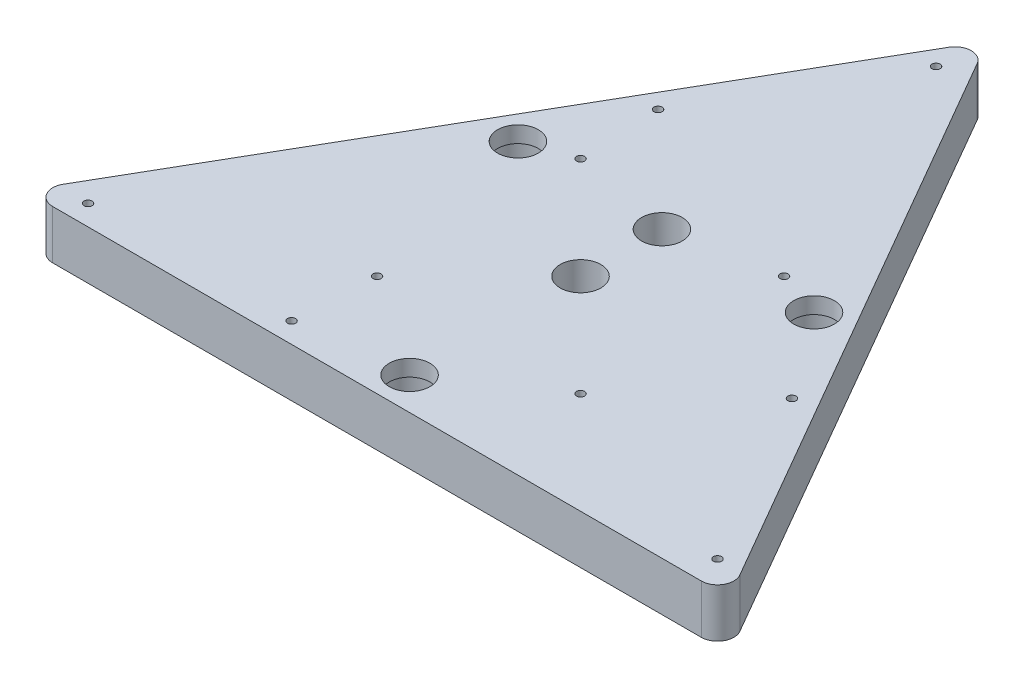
ISO-10303-21;
HEADER;
FILE_DESCRIPTION(('STEP AP214'),'2;1');
FILE_NAME('part.step','',(''),(''),'','','');
FILE_SCHEMA(('AUTOMOTIVE_DESIGN { 1 0 10303 214 1 1 1 1 }'));
ENDSEC;
DATA;
#1=APPLICATION_CONTEXT('core data for automotive mechanical design processes');
#2=APPLICATION_PROTOCOL_DEFINITION('international standard','automotive_design',2000,#1);
#3=PRODUCT_CONTEXT('',#1,'mechanical');
#4=PRODUCT('Part','Part','',(#3));
#5=PRODUCT_RELATED_PRODUCT_CATEGORY('part','',(#4));
#6=PRODUCT_DEFINITION_FORMATION('','',#4);
#7=PRODUCT_DEFINITION_CONTEXT('part definition',#1,'design');
#8=PRODUCT_DEFINITION('design','',#6,#7);
#9=PRODUCT_DEFINITION_SHAPE('','',#8);
#10=(LENGTH_UNIT() NAMED_UNIT(*) SI_UNIT(.MILLI.,.METRE.));
#11=(NAMED_UNIT(*) PLANE_ANGLE_UNIT() SI_UNIT($,.RADIAN.));
#12=(NAMED_UNIT(*) SI_UNIT($,.STERADIAN.) SOLID_ANGLE_UNIT());
#13=UNCERTAINTY_MEASURE_WITH_UNIT(LENGTH_MEASURE(1.E-05),#10,'distance_accuracy_value','');
#14=(GEOMETRIC_REPRESENTATION_CONTEXT(3) GLOBAL_UNCERTAINTY_ASSIGNED_CONTEXT((#13)) GLOBAL_UNIT_ASSIGNED_CONTEXT((#10,
#11,#12)) REPRESENTATION_CONTEXT('',''));
#15=CARTESIAN_POINT('',(0.,0.,0.));
#16=DIRECTION('',(0.,0.,1.));
#17=DIRECTION('',(1.,0.,0.));
#18=AXIS2_PLACEMENT_3D('',#15,#16,#17);
#19=CARTESIAN_POINT('',(43.3012701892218,-6.,25.0000000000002));
#20=DIRECTION('',(0.,1.,0.));
#21=DIRECTION('',(0.,0.,1.));
#22=AXIS2_PLACEMENT_3D('',#19,#20,#21);
#23=PLANE('',#22);
#24=CARTESIAN_POINT('',(18.1726583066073,-6.,-10.4919891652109));
#25=DIRECTION('',(0.,1.,0.));
#26=DIRECTION('',(0.,0.,1.));
#27=AXIS2_PLACEMENT_3D('',#24,#25,#26);
#28=CIRCLE('',#27,3.25);
#29=CARTESIAN_POINT('',(18.1726583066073,-6.,-7.24198916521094));
#30=VERTEX_POINT('',#29);
#31=EDGE_CURVE('E139',#30,#30,#28,.T.);
#32=ORIENTED_EDGE('',*,*,#31,.T.);
#33=EDGE_LOOP('',(#32));
#34=FACE_BOUND('',#33,.T.);
#35=DIRECTION('',(1.,0.,0.));
#36=VECTOR('',#35,1.);
#37=CARTESIAN_POINT('',(-43.3012701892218,-6.,25.0000000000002));
#38=LINE('',#37,#36);
#39=CARTESIAN_POINT('',(-39.8371685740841,-6.,25.0000000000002));
#40=VERTEX_POINT('',#39);
#41=CARTESIAN_POINT('',(39.8371685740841,-6.,25.0000000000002));
#42=VERTEX_POINT('',#41);
#43=EDGE_CURVE('E104',#40,#42,#38,.T.);
#44=ORIENTED_EDGE('',*,*,#43,.F.);
#45=CARTESIAN_POINT('',(-39.8371685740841,-6.,23.0000000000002));
#46=DIRECTION('',(0.,1.,0.));
#47=DIRECTION('',(0.,0.,1.));
#48=AXIS2_PLACEMENT_3D('',#45,#46,#47);
#49=CIRCLE('',#48,2.);
#50=CARTESIAN_POINT('',(-41.5692193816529,-6.,22.0000000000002));
#51=VERTEX_POINT('',#50);
#52=EDGE_CURVE('E123',#40,#51,#49,.F.);
#53=ORIENTED_EDGE('',*,*,#52,.T.);
#54=DIRECTION('',(-0.499999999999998,0.,0.86602540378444));
#55=VECTOR('',#54,1.);
#56=CARTESIAN_POINT('',(0.,-6.,-50.));
#57=LINE('',#56,#55);
#58=CARTESIAN_POINT('',(-1.73205080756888,-6.,-47.));
#59=VERTEX_POINT('',#58);
#60=EDGE_CURVE('E108',#59,#51,#57,.T.);
#61=ORIENTED_EDGE('',*,*,#60,.F.);
#62=CARTESIAN_POINT('',(0.,-6.,-46.));
#63=DIRECTION('',(0.,1.,0.));
#64=DIRECTION('',(0.,0.,1.));
#65=AXIS2_PLACEMENT_3D('',#62,#63,#64);
#66=CIRCLE('',#65,2.);
#67=CARTESIAN_POINT('',(1.73205080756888,-6.,-47.));
#68=VERTEX_POINT('',#67);
#69=EDGE_CURVE('E45',#59,#68,#66,.F.);
#70=ORIENTED_EDGE('',*,*,#69,.T.);
#71=DIRECTION('',(-0.499999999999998,0.,-0.86602540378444));
#72=VECTOR('',#71,1.);
#73=CARTESIAN_POINT('',(0.,-6.,-50.));
#74=LINE('',#73,#72);
#75=CARTESIAN_POINT('',(41.5692193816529,-6.,22.0000000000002));
#76=VERTEX_POINT('',#75);
#77=EDGE_CURVE('E232',#76,#68,#74,.T.);
#78=ORIENTED_EDGE('',*,*,#77,.F.);
#79=CARTESIAN_POINT('',(39.8371685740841,-6.,23.0000000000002));
#80=DIRECTION('',(0.,1.,0.));
#81=DIRECTION('',(0.,0.,1.));
#82=AXIS2_PLACEMENT_3D('',#79,#80,#81);
#83=CIRCLE('',#82,2.);
#84=EDGE_CURVE('E121',#76,#42,#83,.F.);
#85=ORIENTED_EDGE('',*,*,#84,.T.);
#86=EDGE_LOOP('',(#44,#53,#61,#70,#78,#85));
#87=FACE_BOUND('',#86,.T.);
#88=CARTESIAN_POINT('',(0.,-6.,0.));
#89=DIRECTION('',(0.,1.,0.));
#90=DIRECTION('',(0.,0.,1.));
#91=AXIS2_PLACEMENT_3D('',#88,#89,#90);
#92=CIRCLE('',#91,2.5);
#93=CARTESIAN_POINT('',(0.,-6.,2.5));
#94=VERTEX_POINT('',#93);
#95=EDGE_CURVE('E226',#94,#94,#92,.T.);
#96=ORIENTED_EDGE('',*,*,#95,.T.);
#97=EDGE_LOOP('',(#96));
#98=FACE_BOUND('',#97,.T.);
#99=CARTESIAN_POINT('',(38.48557158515,-6.,21.6589653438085));
#100=DIRECTION('',(0.,1.,0.));
#101=DIRECTION('',(0.,0.,1.));
#102=AXIS2_PLACEMENT_3D('',#99,#100,#101);
#103=CIRCLE('',#102,0.500000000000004);
#104=CARTESIAN_POINT('',(38.48557158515,-6.,22.1589653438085));
#105=VERTEX_POINT('',#104);
#106=EDGE_CURVE('E211',#105,#105,#103,.T.);
#107=ORIENTED_EDGE('',*,*,#106,.T.);
#108=EDGE_LOOP('',(#107));
#109=FACE_BOUND('',#108,.T.);
#110=CARTESIAN_POINT('',(25.9855715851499,-6.,0.00833024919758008));
#111=DIRECTION('',(0.,1.,0.));
#112=DIRECTION('',(0.,0.,1.));
#113=AXIS2_PLACEMENT_3D('',#110,#111,#112);
#114=CIRCLE('',#113,0.499999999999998);
#115=CARTESIAN_POINT('',(25.9855715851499,-6.,0.508330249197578));
#116=VERTEX_POINT('',#115);
#117=EDGE_CURVE('E205',#116,#116,#114,.T.);
#118=ORIENTED_EDGE('',*,*,#117,.T.);
#119=EDGE_LOOP('',(#118));
#120=FACE_BOUND('',#119,.T.);
#121=CARTESIAN_POINT('',(-0.48557158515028,-6.,-44.1589653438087));
#122=DIRECTION('',(0.,1.,0.));
#123=DIRECTION('',(0.,0.,1.));
#124=AXIS2_PLACEMENT_3D('',#121,#122,#123);
#125=CIRCLE('',#124,0.499999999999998);
#126=CARTESIAN_POINT('',(-0.48557158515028,-6.,-43.6589653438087));
#127=VERTEX_POINT('',#126);
#128=EDGE_CURVE('E199',#127,#127,#125,.T.);
#129=ORIENTED_EDGE('',*,*,#128,.T.);
#130=EDGE_LOOP('',(#129));
#131=FACE_BOUND('',#130,.T.);
#132=CARTESIAN_POINT('',(-12.9855715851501,-6.,-22.5083302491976));
#133=DIRECTION('',(0.,1.,0.));
#134=DIRECTION('',(0.,0.,1.));
#135=AXIS2_PLACEMENT_3D('',#132,#133,#134);
#136=CIRCLE('',#135,0.499999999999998);
#137=CARTESIAN_POINT('',(-12.9855715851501,-6.,-22.0083302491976));
#138=VERTEX_POINT('',#137);
#139=EDGE_CURVE('E193',#138,#138,#136,.T.);
#140=ORIENTED_EDGE('',*,*,#139,.T.);
#141=EDGE_LOOP('',(#140));
#142=FACE_BOUND('',#141,.T.);
#143=CARTESIAN_POINT('',(0.,-6.,-10.));
#144=DIRECTION('',(0.,1.,0.));
#145=DIRECTION('',(0.,0.,1.));
#146=AXIS2_PLACEMENT_3D('',#143,#144,#145);
#147=CIRCLE('',#146,2.5);
#148=CARTESIAN_POINT('',(0.,-6.,-7.5));
#149=VERTEX_POINT('',#148);
#150=EDGE_CURVE('E187',#149,#149,#147,.T.);
#151=ORIENTED_EDGE('',*,*,#150,.T.);
#152=EDGE_LOOP('',(#151));
#153=FACE_BOUND('',#152,.T.);
#154=CARTESIAN_POINT('',(-38.,-6.,22.5));
#155=DIRECTION('',(0.,1.,0.));
#156=DIRECTION('',(0.,0.,1.));
#157=AXIS2_PLACEMENT_3D('',#154,#155,#156);
#158=CIRCLE('',#157,0.499999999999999);
#159=CARTESIAN_POINT('',(-38.,-6.,23.));
#160=VERTEX_POINT('',#159);
#161=EDGE_CURVE('E181',#160,#160,#158,.T.);
#162=ORIENTED_EDGE('',*,*,#161,.T.);
#163=EDGE_LOOP('',(#162));
#164=FACE_BOUND('',#163,.T.);
#165=CARTESIAN_POINT('',(12.5,-6.,-12.5));
#166=DIRECTION('',(0.,1.,0.));
#167=DIRECTION('',(0.,0.,1.));
#168=AXIS2_PLACEMENT_3D('',#165,#166,#167);
#169=CIRCLE('',#168,0.500000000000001);
#170=CARTESIAN_POINT('',(12.5,-6.,-12.));
#171=VERTEX_POINT('',#170);
#172=EDGE_CURVE('E175',#171,#171,#169,.T.);
#173=ORIENTED_EDGE('',*,*,#172,.T.);
#174=EDGE_LOOP('',(#173));
#175=FACE_BOUND('',#174,.T.);
#176=CARTESIAN_POINT('',(-13.,-6.,22.5));
#177=DIRECTION('',(0.,1.,0.));
#178=DIRECTION('',(0.,0.,1.));
#179=AXIS2_PLACEMENT_3D('',#176,#177,#178);
#180=CIRCLE('',#179,0.499999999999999);
#181=CARTESIAN_POINT('',(-13.,-6.,23.));
#182=VERTEX_POINT('',#181);
#183=EDGE_CURVE('E169',#182,#182,#180,.T.);
#184=ORIENTED_EDGE('',*,*,#183,.T.);
#185=EDGE_LOOP('',(#184));
#186=FACE_BOUND('',#185,.T.);
#187=CARTESIAN_POINT('',(-12.5,-6.,-12.5));
#188=DIRECTION('',(0.,1.,0.));
#189=DIRECTION('',(0.,0.,1.));
#190=AXIS2_PLACEMENT_3D('',#187,#188,#189);
#191=CIRCLE('',#190,0.500000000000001);
#192=CARTESIAN_POINT('',(-12.5,-6.,-12.));
#193=VERTEX_POINT('',#192);
#194=EDGE_CURVE('E163',#193,#193,#191,.T.);
#195=ORIENTED_EDGE('',*,*,#194,.T.);
#196=EDGE_LOOP('',(#195));
#197=FACE_BOUND('',#196,.T.);
#198=CARTESIAN_POINT('',(-12.4999999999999,-6.,12.5000000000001));
#199=DIRECTION('',(0.,1.,0.));
#200=DIRECTION('',(0.,0.,1.));
#201=AXIS2_PLACEMENT_3D('',#198,#199,#200);
#202=CIRCLE('',#201,0.5);
#203=CARTESIAN_POINT('',(-12.4999999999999,-6.,13.0000000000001));
#204=VERTEX_POINT('',#203);
#205=EDGE_CURVE('E157',#204,#204,#202,.T.);
#206=ORIENTED_EDGE('',*,*,#205,.T.);
#207=EDGE_LOOP('',(#206));
#208=FACE_BOUND('',#207,.T.);
#209=CARTESIAN_POINT('',(12.5000000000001,-6.,12.4999999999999));
#210=DIRECTION('',(0.,1.,0.));
#211=DIRECTION('',(0.,0.,1.));
#212=AXIS2_PLACEMENT_3D('',#209,#210,#211);
#213=CIRCLE('',#212,0.500000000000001);
#214=CARTESIAN_POINT('',(12.5000000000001,-6.,12.9999999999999));
#215=VERTEX_POINT('',#214);
#216=EDGE_CURVE('E151',#215,#215,#213,.T.);
#217=ORIENTED_EDGE('',*,*,#216,.T.);
#218=EDGE_LOOP('',(#217));
#219=FACE_BOUND('',#218,.T.);
#220=CARTESIAN_POINT('',(0.,-6.,20.9839783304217));
#221=DIRECTION('',(0.,1.,0.));
#222=DIRECTION('',(0.,0.,1.));
#223=AXIS2_PLACEMENT_3D('',#220,#221,#222);
#224=CIRCLE('',#223,3.25);
#225=CARTESIAN_POINT('',(0.,-6.,24.2339783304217));
#226=VERTEX_POINT('',#225);
#227=EDGE_CURVE('E132',#226,#226,#224,.T.);
#228=ORIENTED_EDGE('',*,*,#227,.T.);
#229=EDGE_LOOP('',(#228));
#230=FACE_BOUND('',#229,.T.);
#231=CARTESIAN_POINT('',(-18.1726583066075,-6.,-10.4919891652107));
#232=DIRECTION('',(0.,1.,0.));
#233=DIRECTION('',(0.,0.,1.));
#234=AXIS2_PLACEMENT_3D('',#231,#232,#233);
#235=CIRCLE('',#234,3.25);
#236=CARTESIAN_POINT('',(-18.1726583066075,-6.,-7.24198916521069));
#237=VERTEX_POINT('',#236);
#238=EDGE_CURVE('E277',#237,#237,#235,.T.);
#239=ORIENTED_EDGE('',*,*,#238,.T.);
#240=EDGE_LOOP('',(#239));
#241=FACE_BOUND('',#240,.T.);
#242=ADVANCED_FACE('F28',(#34,#87,#98,#109,#120,#131,#142,#153,#164,#175,#186,#197,#208,#219,
#230,#241),#23,.F.);
#243=CARTESIAN_POINT('',(0.,-6.,-50.));
#244=DIRECTION('',(0.86602540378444,0.,-0.499999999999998));
#245=DIRECTION('',(-0.499999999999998,0.,-0.86602540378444));
#246=AXIS2_PLACEMENT_3D('',#243,#244,#245);
#247=PLANE('',#246);
#248=DIRECTION('',(-0.499999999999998,0.,-0.86602540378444));
#249=VECTOR('',#248,1.);
#250=CARTESIAN_POINT('',(0.,0.,-50.));
#251=LINE('',#250,#249);
#252=CARTESIAN_POINT('',(41.5692193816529,0.,22.0000000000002));
#253=VERTEX_POINT('',#252);
#254=CARTESIAN_POINT('',(1.73205080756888,0.,-47.));
#255=VERTEX_POINT('',#254);
#256=EDGE_CURVE('E87',#253,#255,#251,.T.);
#257=ORIENTED_EDGE('',*,*,#256,.F.);
#258=DIRECTION('',(0.,1.,0.));
#259=VECTOR('',#258,1.);
#260=CARTESIAN_POINT('',(41.5692193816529,-6.,22.0000000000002));
#261=LINE('',#260,#259);
#262=EDGE_CURVE('E11',#253,#76,#261,.F.);
#263=ORIENTED_EDGE('',*,*,#262,.T.);
#264=ORIENTED_EDGE('',*,*,#77,.T.);
#265=DIRECTION('',(0.,1.,0.));
#266=VECTOR('',#265,1.);
#267=CARTESIAN_POINT('',(1.73205080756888,-6.,-47.));
#268=LINE('',#267,#266);
#269=EDGE_CURVE('E37',#68,#255,#268,.T.);
#270=ORIENTED_EDGE('',*,*,#269,.T.);
#271=EDGE_LOOP('',(#257,#263,#264,#270));
#272=FACE_BOUND('',#271,.T.);
#273=ADVANCED_FACE('F30',(#272),#247,.T.);
#274=CARTESIAN_POINT('',(-43.3012701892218,-6.,25.0000000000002));
#275=DIRECTION('',(0.,0.,1.));
#276=DIRECTION('',(1.,0.,0.));
#277=AXIS2_PLACEMENT_3D('',#274,#275,#276);
#278=PLANE('',#277);
#279=DIRECTION('',(1.,0.,0.));
#280=VECTOR('',#279,1.);
#281=CARTESIAN_POINT('',(-43.3012701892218,0.,25.0000000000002));
#282=LINE('',#281,#280);
#283=CARTESIAN_POINT('',(-39.8371685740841,0.,25.0000000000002));
#284=VERTEX_POINT('',#283);
#285=CARTESIAN_POINT('',(39.8371685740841,0.,25.0000000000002));
#286=VERTEX_POINT('',#285);
#287=EDGE_CURVE('E101',#284,#286,#282,.T.);
#288=ORIENTED_EDGE('',*,*,#287,.F.);
#289=DIRECTION('',(0.,1.,0.));
#290=VECTOR('',#289,1.);
#291=CARTESIAN_POINT('',(-39.8371685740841,-6.,25.0000000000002));
#292=LINE('',#291,#290);
#293=EDGE_CURVE('E118',#284,#40,#292,.F.);
#294=ORIENTED_EDGE('',*,*,#293,.T.);
#295=ORIENTED_EDGE('',*,*,#43,.T.);
#296=DIRECTION('',(0.,1.,0.));
#297=VECTOR('',#296,1.);
#298=CARTESIAN_POINT('',(39.8371685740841,-6.,25.0000000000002));
#299=LINE('',#298,#297);
#300=EDGE_CURVE('E115',#42,#286,#299,.T.);
#301=ORIENTED_EDGE('',*,*,#300,.T.);
#302=EDGE_LOOP('',(#288,#294,#295,#301));
#303=FACE_BOUND('',#302,.T.);
#304=ADVANCED_FACE('F239',(#303),#278,.T.);
#305=CARTESIAN_POINT('',(0.,-6.,-50.));
#306=DIRECTION('',(-0.86602540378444,0.,-0.499999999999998));
#307=DIRECTION('',(-0.499999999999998,0.,0.86602540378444));
#308=AXIS2_PLACEMENT_3D('',#305,#306,#307);
#309=PLANE('',#308);
#310=ORIENTED_EDGE('',*,*,#60,.T.);
#311=DIRECTION('',(0.,1.,0.));
#312=VECTOR('',#311,1.);
#313=CARTESIAN_POINT('',(-41.5692193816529,-6.,22.0000000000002));
#314=LINE('',#313,#312);
#315=CARTESIAN_POINT('',(-41.5692193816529,0.,22.0000000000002));
#316=VERTEX_POINT('',#315);
#317=EDGE_CURVE('E93',#51,#316,#314,.T.);
#318=ORIENTED_EDGE('',*,*,#317,.T.);
#319=DIRECTION('',(-0.499999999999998,0.,0.86602540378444));
#320=VECTOR('',#319,1.);
#321=CARTESIAN_POINT('',(0.,0.,-50.));
#322=LINE('',#321,#320);
#323=CARTESIAN_POINT('',(-1.73205080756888,0.,-47.));
#324=VERTEX_POINT('',#323);
#325=EDGE_CURVE('E86',#324,#316,#322,.T.);
#326=ORIENTED_EDGE('',*,*,#325,.F.);
#327=DIRECTION('',(0.,1.,0.));
#328=VECTOR('',#327,1.);
#329=CARTESIAN_POINT('',(-1.73205080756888,-6.,-47.));
#330=LINE('',#329,#328);
#331=EDGE_CURVE('E99',#324,#59,#330,.F.);
#332=ORIENTED_EDGE('',*,*,#331,.T.);
#333=EDGE_LOOP('',(#310,#318,#326,#332));
#334=FACE_BOUND('',#333,.T.);
#335=ADVANCED_FACE('F98',(#334),#309,.T.);
#336=CARTESIAN_POINT('',(43.3012701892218,0.,25.0000000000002));
#337=DIRECTION('',(0.,1.,0.));
#338=DIRECTION('',(0.,0.,1.));
#339=AXIS2_PLACEMENT_3D('',#336,#337,#338);
#340=PLANE('',#339);
#341=CARTESIAN_POINT('',(12.5000000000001,0.,12.4999999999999));
#342=DIRECTION('',(0.,1.,0.));
#343=DIRECTION('',(0.,0.,1.));
#344=AXIS2_PLACEMENT_3D('',#341,#342,#343);
#345=CIRCLE('',#344,0.500000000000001);
#346=CARTESIAN_POINT('',(12.5000000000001,0.,12.9999999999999));
#347=VERTEX_POINT('',#346);
#348=EDGE_CURVE('E128',#347,#347,#345,.T.);
#349=ORIENTED_EDGE('',*,*,#348,.F.);
#350=EDGE_LOOP('',(#349));
#351=FACE_BOUND('',#350,.T.);
#352=CARTESIAN_POINT('',(-12.4999999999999,0.,12.5000000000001));
#353=DIRECTION('',(0.,1.,0.));
#354=DIRECTION('',(0.,0.,1.));
#355=AXIS2_PLACEMENT_3D('',#352,#353,#354);
#356=CIRCLE('',#355,0.5);
#357=CARTESIAN_POINT('',(-12.4999999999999,0.,13.0000000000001));
#358=VERTEX_POINT('',#357);
#359=EDGE_CURVE('E154',#358,#358,#356,.T.);
#360=ORIENTED_EDGE('',*,*,#359,.F.);
#361=EDGE_LOOP('',(#360));
#362=FACE_BOUND('',#361,.T.);
#363=CARTESIAN_POINT('',(-12.5,0.,-12.5));
#364=DIRECTION('',(0.,1.,0.));
#365=DIRECTION('',(0.,0.,1.));
#366=AXIS2_PLACEMENT_3D('',#363,#364,#365);
#367=CIRCLE('',#366,0.500000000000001);
#368=CARTESIAN_POINT('',(-12.5,0.,-12.));
#369=VERTEX_POINT('',#368);
#370=EDGE_CURVE('E160',#369,#369,#367,.T.);
#371=ORIENTED_EDGE('',*,*,#370,.F.);
#372=EDGE_LOOP('',(#371));
#373=FACE_BOUND('',#372,.T.);
#374=CARTESIAN_POINT('',(-13.,0.,22.5));
#375=DIRECTION('',(0.,1.,0.));
#376=DIRECTION('',(0.,0.,1.));
#377=AXIS2_PLACEMENT_3D('',#374,#375,#376);
#378=CIRCLE('',#377,0.499999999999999);
#379=CARTESIAN_POINT('',(-13.,0.,23.));
#380=VERTEX_POINT('',#379);
#381=EDGE_CURVE('E166',#380,#380,#378,.T.);
#382=ORIENTED_EDGE('',*,*,#381,.F.);
#383=EDGE_LOOP('',(#382));
#384=FACE_BOUND('',#383,.T.);
#385=CARTESIAN_POINT('',(12.5,0.,-12.5));
#386=DIRECTION('',(0.,1.,0.));
#387=DIRECTION('',(0.,0.,1.));
#388=AXIS2_PLACEMENT_3D('',#385,#386,#387);
#389=CIRCLE('',#388,0.500000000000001);
#390=CARTESIAN_POINT('',(12.5,0.,-12.));
#391=VERTEX_POINT('',#390);
#392=EDGE_CURVE('E172',#391,#391,#389,.T.);
#393=ORIENTED_EDGE('',*,*,#392,.F.);
#394=EDGE_LOOP('',(#393));
#395=FACE_BOUND('',#394,.T.);
#396=CARTESIAN_POINT('',(-38.,0.,22.5));
#397=DIRECTION('',(0.,1.,0.));
#398=DIRECTION('',(0.,0.,1.));
#399=AXIS2_PLACEMENT_3D('',#396,#397,#398);
#400=CIRCLE('',#399,0.499999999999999);
#401=CARTESIAN_POINT('',(-38.,0.,23.));
#402=VERTEX_POINT('',#401);
#403=EDGE_CURVE('E178',#402,#402,#400,.T.);
#404=ORIENTED_EDGE('',*,*,#403,.F.);
#405=EDGE_LOOP('',(#404));
#406=FACE_BOUND('',#405,.T.);
#407=CARTESIAN_POINT('',(0.,0.,-10.));
#408=DIRECTION('',(0.,1.,0.));
#409=DIRECTION('',(0.,0.,1.));
#410=AXIS2_PLACEMENT_3D('',#407,#408,#409);
#411=CIRCLE('',#410,2.5);
#412=CARTESIAN_POINT('',(0.,0.,-7.5));
#413=VERTEX_POINT('',#412);
#414=EDGE_CURVE('E184',#413,#413,#411,.T.);
#415=ORIENTED_EDGE('',*,*,#414,.F.);
#416=EDGE_LOOP('',(#415));
#417=FACE_BOUND('',#416,.T.);
#418=CARTESIAN_POINT('',(-12.9855715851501,0.,-22.5083302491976));
#419=DIRECTION('',(0.,1.,0.));
#420=DIRECTION('',(0.,0.,1.));
#421=AXIS2_PLACEMENT_3D('',#418,#419,#420);
#422=CIRCLE('',#421,0.499999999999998);
#423=CARTESIAN_POINT('',(-12.9855715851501,0.,-22.0083302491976));
#424=VERTEX_POINT('',#423);
#425=EDGE_CURVE('E190',#424,#424,#422,.T.);
#426=ORIENTED_EDGE('',*,*,#425,.F.);
#427=EDGE_LOOP('',(#426));
#428=FACE_BOUND('',#427,.T.);
#429=CARTESIAN_POINT('',(-0.48557158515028,0.,-44.1589653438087));
#430=DIRECTION('',(0.,1.,0.));
#431=DIRECTION('',(0.,0.,1.));
#432=AXIS2_PLACEMENT_3D('',#429,#430,#431);
#433=CIRCLE('',#432,0.499999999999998);
#434=CARTESIAN_POINT('',(-0.48557158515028,0.,-43.6589653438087));
#435=VERTEX_POINT('',#434);
#436=EDGE_CURVE('E196',#435,#435,#433,.T.);
#437=ORIENTED_EDGE('',*,*,#436,.F.);
#438=EDGE_LOOP('',(#437));
#439=FACE_BOUND('',#438,.T.);
#440=CARTESIAN_POINT('',(25.9855715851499,0.,0.00833024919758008));
#441=DIRECTION('',(0.,1.,0.));
#442=DIRECTION('',(0.,0.,1.));
#443=AXIS2_PLACEMENT_3D('',#440,#441,#442);
#444=CIRCLE('',#443,0.499999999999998);
#445=CARTESIAN_POINT('',(25.9855715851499,0.,0.508330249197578));
#446=VERTEX_POINT('',#445);
#447=EDGE_CURVE('E202',#446,#446,#444,.T.);
#448=ORIENTED_EDGE('',*,*,#447,.F.);
#449=EDGE_LOOP('',(#448));
#450=FACE_BOUND('',#449,.T.);
#451=CARTESIAN_POINT('',(38.48557158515,0.,21.6589653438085));
#452=DIRECTION('',(0.,1.,0.));
#453=DIRECTION('',(0.,0.,1.));
#454=AXIS2_PLACEMENT_3D('',#451,#452,#453);
#455=CIRCLE('',#454,0.500000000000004);
#456=CARTESIAN_POINT('',(38.48557158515,0.,22.1589653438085));
#457=VERTEX_POINT('',#456);
#458=EDGE_CURVE('E208',#457,#457,#455,.T.);
#459=ORIENTED_EDGE('',*,*,#458,.F.);
#460=EDGE_LOOP('',(#459));
#461=FACE_BOUND('',#460,.T.);
#462=CARTESIAN_POINT('',(18.186533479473,0.,-10.5000000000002));
#463=DIRECTION('',(0.,1.,0.));
#464=DIRECTION('',(0.,0.,1.));
#465=AXIS2_PLACEMENT_3D('',#462,#463,#464);
#466=CIRCLE('',#465,2.5);
#467=CARTESIAN_POINT('',(18.186533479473,0.,-8.00000000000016));
#468=VERTEX_POINT('',#467);
#469=EDGE_CURVE('E214',#468,#468,#466,.T.);
#470=ORIENTED_EDGE('',*,*,#469,.F.);
#471=EDGE_LOOP('',(#470));
#472=FACE_BOUND('',#471,.T.);
#473=CARTESIAN_POINT('',(1.50310231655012E-13,0.,20.9999999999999));
#474=DIRECTION('',(0.,1.,0.));
#475=DIRECTION('',(0.,0.,1.));
#476=AXIS2_PLACEMENT_3D('',#473,#474,#475);
#477=CIRCLE('',#476,2.5);
#478=CARTESIAN_POINT('',(1.50310231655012E-13,0.,23.4999999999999));
#479=VERTEX_POINT('',#478);
#480=EDGE_CURVE('E217',#479,#479,#477,.T.);
#481=ORIENTED_EDGE('',*,*,#480,.F.);
#482=EDGE_LOOP('',(#481));
#483=FACE_BOUND('',#482,.T.);
#484=CARTESIAN_POINT('',(-18.1865334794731,0.,-10.4999999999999));
#485=DIRECTION('',(0.,1.,0.));
#486=DIRECTION('',(0.,0.,1.));
#487=AXIS2_PLACEMENT_3D('',#484,#485,#486);
#488=CIRCLE('',#487,2.5);
#489=CARTESIAN_POINT('',(-18.1865334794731,0.,-7.9999999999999));
#490=VERTEX_POINT('',#489);
#491=EDGE_CURVE('E220',#490,#490,#488,.T.);
#492=ORIENTED_EDGE('',*,*,#491,.F.);
#493=EDGE_LOOP('',(#492));
#494=FACE_BOUND('',#493,.T.);
#495=CARTESIAN_POINT('',(0.,0.,0.));
#496=DIRECTION('',(0.,1.,0.));
#497=DIRECTION('',(0.,0.,1.));
#498=AXIS2_PLACEMENT_3D('',#495,#496,#497);
#499=CIRCLE('',#498,2.5);
#500=CARTESIAN_POINT('',(0.,0.,2.5));
#501=VERTEX_POINT('',#500);
#502=EDGE_CURVE('E223',#501,#501,#499,.T.);
#503=ORIENTED_EDGE('',*,*,#502,.F.);
#504=EDGE_LOOP('',(#503));
#505=FACE_BOUND('',#504,.T.);
#506=ORIENTED_EDGE('',*,*,#325,.T.);
#507=CARTESIAN_POINT('',(-39.8371685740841,0.,23.0000000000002));
#508=DIRECTION('',(0.,1.,0.));
#509=DIRECTION('',(0.,0.,1.));
#510=AXIS2_PLACEMENT_3D('',#507,#508,#509);
#511=CIRCLE('',#510,2.);
#512=EDGE_CURVE('E113',#316,#284,#511,.T.);
#513=ORIENTED_EDGE('',*,*,#512,.T.);
#514=ORIENTED_EDGE('',*,*,#287,.T.);
#515=CARTESIAN_POINT('',(39.8371685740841,0.,23.0000000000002));
#516=DIRECTION('',(0.,1.,0.));
#517=DIRECTION('',(0.,0.,1.));
#518=AXIS2_PLACEMENT_3D('',#515,#516,#517);
#519=CIRCLE('',#518,2.);
#520=EDGE_CURVE('E92',#286,#253,#519,.T.);
#521=ORIENTED_EDGE('',*,*,#520,.T.);
#522=ORIENTED_EDGE('',*,*,#256,.T.);
#523=CARTESIAN_POINT('',(0.,0.,-46.));
#524=DIRECTION('',(0.,1.,0.));
#525=DIRECTION('',(0.,0.,1.));
#526=AXIS2_PLACEMENT_3D('',#523,#524,#525);
#527=CIRCLE('',#526,2.);
#528=EDGE_CURVE('E83',#255,#324,#527,.T.);
#529=ORIENTED_EDGE('',*,*,#528,.T.);
#530=EDGE_LOOP('',(#506,#513,#514,#521,#522,#529));
#531=FACE_BOUND('',#530,.T.);
#532=ADVANCED_FACE('F85',(#351,#362,#373,#384,#395,#406,#417,#428,#439,#450,#461,#472,#483,#494,
#505,#531),#340,.T.);
#533=CARTESIAN_POINT('',(0.,-6.,0.));
#534=DIRECTION('',(0.,1.,0.));
#535=DIRECTION('',(0.,0.,1.));
#536=AXIS2_PLACEMENT_3D('',#533,#534,#535);
#537=CYLINDRICAL_SURFACE('',#536,2.5);
#538=ORIENTED_EDGE('',*,*,#95,.F.);
#539=EDGE_LOOP('',(#538));
#540=FACE_BOUND('',#539,.T.);
#541=ORIENTED_EDGE('',*,*,#502,.T.);
#542=EDGE_LOOP('',(#541));
#543=FACE_BOUND('',#542,.T.);
#544=ADVANCED_FACE('F374',(#540,#543),#537,.F.);
#545=CARTESIAN_POINT('',(-18.1865334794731,-6.,-10.4999999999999));
#546=DIRECTION('',(0.,1.,0.));
#547=DIRECTION('',(0.,0.,1.));
#548=AXIS2_PLACEMENT_3D('',#545,#546,#547);
#549=CYLINDRICAL_SURFACE('',#548,2.5);
#550=CARTESIAN_POINT('',(-18.1865334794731,-2.,-10.4999999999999));
#551=DIRECTION('',(0.,1.,0.));
#552=DIRECTION('',(0.,0.,1.));
#553=AXIS2_PLACEMENT_3D('',#550,#551,#552);
#554=CIRCLE('',#553,2.5);
#555=CARTESIAN_POINT('',(-18.1865334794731,-2.,-7.9999999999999));
#556=VERTEX_POINT('',#555);
#557=EDGE_CURVE('E32',#556,#556,#554,.F.);
#558=ORIENTED_EDGE('',*,*,#557,.T.);
#559=EDGE_LOOP('',(#558));
#560=FACE_BOUND('',#559,.T.);
#561=ORIENTED_EDGE('',*,*,#491,.T.);
#562=EDGE_LOOP('',(#561));
#563=FACE_BOUND('',#562,.T.);
#564=ADVANCED_FACE('F287',(#560,#563),#549,.F.);
#565=CARTESIAN_POINT('',(1.50310231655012E-13,-6.,20.9999999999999));
#566=DIRECTION('',(0.,1.,0.));
#567=DIRECTION('',(0.,0.,1.));
#568=AXIS2_PLACEMENT_3D('',#565,#566,#567);
#569=CYLINDRICAL_SURFACE('',#568,2.5);
#570=CARTESIAN_POINT('',(1.50310231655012E-13,-2.,20.9999999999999));
#571=DIRECTION('',(0.,1.,0.));
#572=DIRECTION('',(0.,0.,1.));
#573=AXIS2_PLACEMENT_3D('',#570,#571,#572);
#574=CIRCLE('',#573,2.5);
#575=CARTESIAN_POINT('',(1.50310231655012E-13,-2.,23.4999999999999));
#576=VERTEX_POINT('',#575);
#577=EDGE_CURVE('E126',#576,#576,#574,.F.);
#578=ORIENTED_EDGE('',*,*,#577,.T.);
#579=EDGE_LOOP('',(#578));
#580=FACE_BOUND('',#579,.T.);
#581=ORIENTED_EDGE('',*,*,#480,.T.);
#582=EDGE_LOOP('',(#581));
#583=FACE_BOUND('',#582,.T.);
#584=ADVANCED_FACE('F368',(#580,#583),#569,.F.);
#585=CARTESIAN_POINT('',(18.186533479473,-6.,-10.5000000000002));
#586=DIRECTION('',(0.,1.,0.));
#587=DIRECTION('',(0.,0.,1.));
#588=AXIS2_PLACEMENT_3D('',#585,#586,#587);
#589=CYLINDRICAL_SURFACE('',#588,2.5);
#590=CARTESIAN_POINT('',(18.186533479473,-2.,-10.5000000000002));
#591=DIRECTION('',(0.,1.,0.));
#592=DIRECTION('',(0.,0.,1.));
#593=AXIS2_PLACEMENT_3D('',#590,#591,#592);
#594=CIRCLE('',#593,2.5);
#595=CARTESIAN_POINT('',(18.186533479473,-2.,-8.00000000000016));
#596=VERTEX_POINT('',#595);
#597=EDGE_CURVE('E130',#596,#596,#594,.F.);
#598=ORIENTED_EDGE('',*,*,#597,.T.);
#599=EDGE_LOOP('',(#598));
#600=FACE_BOUND('',#599,.T.);
#601=ORIENTED_EDGE('',*,*,#469,.T.);
#602=EDGE_LOOP('',(#601));
#603=FACE_BOUND('',#602,.T.);
#604=ADVANCED_FACE('F364',(#600,#603),#589,.F.);
#605=CARTESIAN_POINT('',(38.48557158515,-6.,21.6589653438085));
#606=DIRECTION('',(0.,1.,0.));
#607=DIRECTION('',(0.,0.,1.));
#608=AXIS2_PLACEMENT_3D('',#605,#606,#607);
#609=CYLINDRICAL_SURFACE('',#608,0.500000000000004);
#610=ORIENTED_EDGE('',*,*,#106,.F.);
#611=EDGE_LOOP('',(#610));
#612=FACE_BOUND('',#611,.T.);
#613=ORIENTED_EDGE('',*,*,#458,.T.);
#614=EDGE_LOOP('',(#613));
#615=FACE_BOUND('',#614,.T.);
#616=ADVANCED_FACE('F360',(#612,#615),#609,.F.);
#617=CARTESIAN_POINT('',(25.9855715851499,-6.,0.00833024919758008));
#618=DIRECTION('',(0.,1.,0.));
#619=DIRECTION('',(0.,0.,1.));
#620=AXIS2_PLACEMENT_3D('',#617,#618,#619);
#621=CYLINDRICAL_SURFACE('',#620,0.499999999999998);
#622=ORIENTED_EDGE('',*,*,#117,.F.);
#623=EDGE_LOOP('',(#622));
#624=FACE_BOUND('',#623,.T.);
#625=ORIENTED_EDGE('',*,*,#447,.T.);
#626=EDGE_LOOP('',(#625));
#627=FACE_BOUND('',#626,.T.);
#628=ADVANCED_FACE('F356',(#624,#627),#621,.F.);
#629=CARTESIAN_POINT('',(-0.48557158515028,-6.,-44.1589653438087));
#630=DIRECTION('',(0.,1.,0.));
#631=DIRECTION('',(0.,0.,1.));
#632=AXIS2_PLACEMENT_3D('',#629,#630,#631);
#633=CYLINDRICAL_SURFACE('',#632,0.499999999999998);
#634=ORIENTED_EDGE('',*,*,#128,.F.);
#635=EDGE_LOOP('',(#634));
#636=FACE_BOUND('',#635,.T.);
#637=ORIENTED_EDGE('',*,*,#436,.T.);
#638=EDGE_LOOP('',(#637));
#639=FACE_BOUND('',#638,.T.);
#640=ADVANCED_FACE('F352',(#636,#639),#633,.F.);
#641=CARTESIAN_POINT('',(-12.9855715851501,-6.,-22.5083302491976));
#642=DIRECTION('',(0.,1.,0.));
#643=DIRECTION('',(0.,0.,1.));
#644=AXIS2_PLACEMENT_3D('',#641,#642,#643);
#645=CYLINDRICAL_SURFACE('',#644,0.499999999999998);
#646=ORIENTED_EDGE('',*,*,#139,.F.);
#647=EDGE_LOOP('',(#646));
#648=FACE_BOUND('',#647,.T.);
#649=ORIENTED_EDGE('',*,*,#425,.T.);
#650=EDGE_LOOP('',(#649));
#651=FACE_BOUND('',#650,.T.);
#652=ADVANCED_FACE('F348',(#648,#651),#645,.F.);
#653=CARTESIAN_POINT('',(0.,-6.,-10.));
#654=DIRECTION('',(0.,1.,0.));
#655=DIRECTION('',(0.,0.,1.));
#656=AXIS2_PLACEMENT_3D('',#653,#654,#655);
#657=CYLINDRICAL_SURFACE('',#656,2.5);
#658=ORIENTED_EDGE('',*,*,#150,.F.);
#659=EDGE_LOOP('',(#658));
#660=FACE_BOUND('',#659,.T.);
#661=ORIENTED_EDGE('',*,*,#414,.T.);
#662=EDGE_LOOP('',(#661));
#663=FACE_BOUND('',#662,.T.);
#664=ADVANCED_FACE('F344',(#660,#663),#657,.F.);
#665=CARTESIAN_POINT('',(-38.,-6.,22.5));
#666=DIRECTION('',(0.,1.,0.));
#667=DIRECTION('',(0.,0.,1.));
#668=AXIS2_PLACEMENT_3D('',#665,#666,#667);
#669=CYLINDRICAL_SURFACE('',#668,0.499999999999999);
#670=ORIENTED_EDGE('',*,*,#161,.F.);
#671=EDGE_LOOP('',(#670));
#672=FACE_BOUND('',#671,.T.);
#673=ORIENTED_EDGE('',*,*,#403,.T.);
#674=EDGE_LOOP('',(#673));
#675=FACE_BOUND('',#674,.T.);
#676=ADVANCED_FACE('F340',(#672,#675),#669,.F.);
#677=CARTESIAN_POINT('',(12.5,-6.,-12.5));
#678=DIRECTION('',(0.,1.,0.));
#679=DIRECTION('',(0.,0.,1.));
#680=AXIS2_PLACEMENT_3D('',#677,#678,#679);
#681=CYLINDRICAL_SURFACE('',#680,0.500000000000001);
#682=ORIENTED_EDGE('',*,*,#172,.F.);
#683=EDGE_LOOP('',(#682));
#684=FACE_BOUND('',#683,.T.);
#685=ORIENTED_EDGE('',*,*,#392,.T.);
#686=EDGE_LOOP('',(#685));
#687=FACE_BOUND('',#686,.T.);
#688=ADVANCED_FACE('F336',(#684,#687),#681,.F.);
#689=CARTESIAN_POINT('',(-13.,-6.,22.5));
#690=DIRECTION('',(0.,1.,0.));
#691=DIRECTION('',(0.,0.,1.));
#692=AXIS2_PLACEMENT_3D('',#689,#690,#691);
#693=CYLINDRICAL_SURFACE('',#692,0.499999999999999);
#694=ORIENTED_EDGE('',*,*,#183,.F.);
#695=EDGE_LOOP('',(#694));
#696=FACE_BOUND('',#695,.T.);
#697=ORIENTED_EDGE('',*,*,#381,.T.);
#698=EDGE_LOOP('',(#697));
#699=FACE_BOUND('',#698,.T.);
#700=ADVANCED_FACE('F332',(#696,#699),#693,.F.);
#701=CARTESIAN_POINT('',(-12.5,-6.,-12.5));
#702=DIRECTION('',(0.,1.,0.));
#703=DIRECTION('',(0.,0.,1.));
#704=AXIS2_PLACEMENT_3D('',#701,#702,#703);
#705=CYLINDRICAL_SURFACE('',#704,0.500000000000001);
#706=ORIENTED_EDGE('',*,*,#194,.F.);
#707=EDGE_LOOP('',(#706));
#708=FACE_BOUND('',#707,.T.);
#709=ORIENTED_EDGE('',*,*,#370,.T.);
#710=EDGE_LOOP('',(#709));
#711=FACE_BOUND('',#710,.T.);
#712=ADVANCED_FACE('F328',(#708,#711),#705,.F.);
#713=CARTESIAN_POINT('',(-12.4999999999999,-6.,12.5000000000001));
#714=DIRECTION('',(0.,1.,0.));
#715=DIRECTION('',(0.,0.,1.));
#716=AXIS2_PLACEMENT_3D('',#713,#714,#715);
#717=CYLINDRICAL_SURFACE('',#716,0.5);
#718=ORIENTED_EDGE('',*,*,#205,.F.);
#719=EDGE_LOOP('',(#718));
#720=FACE_BOUND('',#719,.T.);
#721=ORIENTED_EDGE('',*,*,#359,.T.);
#722=EDGE_LOOP('',(#721));
#723=FACE_BOUND('',#722,.T.);
#724=ADVANCED_FACE('F324',(#720,#723),#717,.F.);
#725=CARTESIAN_POINT('',(12.5000000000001,-6.,12.4999999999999));
#726=DIRECTION('',(0.,1.,0.));
#727=DIRECTION('',(0.,0.,1.));
#728=AXIS2_PLACEMENT_3D('',#725,#726,#727);
#729=CYLINDRICAL_SURFACE('',#728,0.500000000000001);
#730=ORIENTED_EDGE('',*,*,#216,.F.);
#731=EDGE_LOOP('',(#730));
#732=FACE_BOUND('',#731,.T.);
#733=ORIENTED_EDGE('',*,*,#348,.T.);
#734=EDGE_LOOP('',(#733));
#735=FACE_BOUND('',#734,.T.);
#736=ADVANCED_FACE('F321',(#732,#735),#729,.F.);
#737=CARTESIAN_POINT('',(-39.8371685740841,-6.,23.0000000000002));
#738=DIRECTION('',(0.,1.,0.));
#739=DIRECTION('',(0.,0.,1.));
#740=AXIS2_PLACEMENT_3D('',#737,#738,#739);
#741=CYLINDRICAL_SURFACE('',#740,2.);
#742=ORIENTED_EDGE('',*,*,#52,.F.);
#743=ORIENTED_EDGE('',*,*,#293,.F.);
#744=ORIENTED_EDGE('',*,*,#512,.F.);
#745=ORIENTED_EDGE('',*,*,#317,.F.);
#746=EDGE_LOOP('',(#742,#743,#744,#745));
#747=FACE_BOUND('',#746,.T.);
#748=ADVANCED_FACE('F235',(#747),#741,.T.);
#749=CARTESIAN_POINT('',(39.8371685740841,-6.,23.0000000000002));
#750=DIRECTION('',(0.,1.,0.));
#751=DIRECTION('',(0.,0.,1.));
#752=AXIS2_PLACEMENT_3D('',#749,#750,#751);
#753=CYLINDRICAL_SURFACE('',#752,2.);
#754=ORIENTED_EDGE('',*,*,#84,.F.);
#755=ORIENTED_EDGE('',*,*,#262,.F.);
#756=ORIENTED_EDGE('',*,*,#520,.F.);
#757=ORIENTED_EDGE('',*,*,#300,.F.);
#758=EDGE_LOOP('',(#754,#755,#756,#757));
#759=FACE_BOUND('',#758,.T.);
#760=ADVANCED_FACE('F244',(#759),#753,.T.);
#761=CARTESIAN_POINT('',(0.,-6.,-46.));
#762=DIRECTION('',(0.,1.,0.));
#763=DIRECTION('',(0.,0.,1.));
#764=AXIS2_PLACEMENT_3D('',#761,#762,#763);
#765=CYLINDRICAL_SURFACE('',#764,2.);
#766=ORIENTED_EDGE('',*,*,#69,.F.);
#767=ORIENTED_EDGE('',*,*,#331,.F.);
#768=ORIENTED_EDGE('',*,*,#528,.F.);
#769=ORIENTED_EDGE('',*,*,#269,.F.);
#770=EDGE_LOOP('',(#766,#767,#768,#769));
#771=FACE_BOUND('',#770,.T.);
#772=ADVANCED_FACE('F103',(#771),#765,.T.);
#773=CARTESIAN_POINT('',(0.,-2.,20.9839783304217));
#774=DIRECTION('',(0.,1.,0.));
#775=DIRECTION('',(0.,0.,1.));
#776=AXIS2_PLACEMENT_3D('',#773,#774,#775);
#777=PLANE('',#776);
#778=CARTESIAN_POINT('',(0.,-2.,20.9839783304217));
#779=DIRECTION('',(0.,1.,0.));
#780=DIRECTION('',(0.,0.,1.));
#781=AXIS2_PLACEMENT_3D('',#778,#779,#780);
#782=CIRCLE('',#781,3.25);
#783=CARTESIAN_POINT('',(0.,-2.,24.2339783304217));
#784=VERTEX_POINT('',#783);
#785=EDGE_CURVE('E129',#784,#784,#782,.T.);
#786=ORIENTED_EDGE('',*,*,#785,.F.);
#787=EDGE_LOOP('',(#786));
#788=FACE_BOUND('',#787,.T.);
#789=ORIENTED_EDGE('',*,*,#577,.F.);
#790=EDGE_LOOP('',(#789));
#791=FACE_BOUND('',#790,.T.);
#792=ADVANCED_FACE('F308',(#788,#791),#777,.F.);
#793=CARTESIAN_POINT('',(0.,-2.,20.9839783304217));
#794=DIRECTION('',(0.,-1.,0.));
#795=DIRECTION('',(0.,0.,-1.));
#796=AXIS2_PLACEMENT_3D('',#793,#794,#795);
#797=CYLINDRICAL_SURFACE('',#796,3.25);
#798=ORIENTED_EDGE('',*,*,#785,.T.);
#799=EDGE_LOOP('',(#798));
#800=FACE_BOUND('',#799,.T.);
#801=ORIENTED_EDGE('',*,*,#227,.F.);
#802=EDGE_LOOP('',(#801));
#803=FACE_BOUND('',#802,.T.);
#804=ADVANCED_FACE('F305',(#800,#803),#797,.F.);
#805=CARTESIAN_POINT('',(18.1726583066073,-2.,-10.4919891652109));
#806=DIRECTION('',(0.,1.,0.));
#807=DIRECTION('',(0.,0.,1.));
#808=AXIS2_PLACEMENT_3D('',#805,#806,#807);
#809=PLANE('',#808);
#810=CARTESIAN_POINT('',(18.1726583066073,-2.,-10.4919891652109));
#811=DIRECTION('',(0.,1.,0.));
#812=DIRECTION('',(0.,0.,1.));
#813=AXIS2_PLACEMENT_3D('',#810,#811,#812);
#814=CIRCLE('',#813,3.25);
#815=CARTESIAN_POINT('',(18.1726583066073,-2.,-7.24198916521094));
#816=VERTEX_POINT('',#815);
#817=EDGE_CURVE('E133',#816,#816,#814,.T.);
#818=ORIENTED_EDGE('',*,*,#817,.F.);
#819=EDGE_LOOP('',(#818));
#820=FACE_BOUND('',#819,.T.);
#821=ORIENTED_EDGE('',*,*,#597,.F.);
#822=EDGE_LOOP('',(#821));
#823=FACE_BOUND('',#822,.T.);
#824=ADVANCED_FACE('F301',(#820,#823),#809,.F.);
#825=CARTESIAN_POINT('',(18.1726583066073,-2.,-10.4919891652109));
#826=DIRECTION('',(0.,-1.,0.));
#827=DIRECTION('',(0.,0.,-1.));
#828=AXIS2_PLACEMENT_3D('',#825,#826,#827);
#829=CYLINDRICAL_SURFACE('',#828,3.25);
#830=ORIENTED_EDGE('',*,*,#817,.T.);
#831=EDGE_LOOP('',(#830));
#832=FACE_BOUND('',#831,.T.);
#833=ORIENTED_EDGE('',*,*,#31,.F.);
#834=EDGE_LOOP('',(#833));
#835=FACE_BOUND('',#834,.T.);
#836=ADVANCED_FACE('F293',(#832,#835),#829,.F.);
#837=CARTESIAN_POINT('',(-18.1726583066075,-2.,-10.4919891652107));
#838=DIRECTION('',(0.,1.,0.));
#839=DIRECTION('',(0.,0.,1.));
#840=AXIS2_PLACEMENT_3D('',#837,#838,#839);
#841=PLANE('',#840);
#842=CARTESIAN_POINT('',(-18.1726583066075,-2.,-10.4919891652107));
#843=DIRECTION('',(0.,1.,0.));
#844=DIRECTION('',(0.,0.,1.));
#845=AXIS2_PLACEMENT_3D('',#842,#843,#844);
#846=CIRCLE('',#845,3.25);
#847=CARTESIAN_POINT('',(-18.1726583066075,-2.,-7.24198916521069));
#848=VERTEX_POINT('',#847);
#849=EDGE_CURVE('E279',#848,#848,#846,.T.);
#850=ORIENTED_EDGE('',*,*,#849,.F.);
#851=EDGE_LOOP('',(#850));
#852=FACE_BOUND('',#851,.T.);
#853=ORIENTED_EDGE('',*,*,#557,.F.);
#854=EDGE_LOOP('',(#853));
#855=FACE_BOUND('',#854,.T.);
#856=ADVANCED_FACE('F290',(#852,#855),#841,.F.);
#857=CARTESIAN_POINT('',(-18.1726583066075,-2.,-10.4919891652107));
#858=DIRECTION('',(0.,-1.,0.));
#859=DIRECTION('',(0.,0.,-1.));
#860=AXIS2_PLACEMENT_3D('',#857,#858,#859);
#861=CYLINDRICAL_SURFACE('',#860,3.25);
#862=ORIENTED_EDGE('',*,*,#849,.T.);
#863=EDGE_LOOP('',(#862));
#864=FACE_BOUND('',#863,.T.);
#865=ORIENTED_EDGE('',*,*,#238,.F.);
#866=EDGE_LOOP('',(#865));
#867=FACE_BOUND('',#866,.T.);
#868=ADVANCED_FACE('F292',(#864,#867),#861,.F.);
#869=CLOSED_SHELL('',(#242,#273,#304,#335,#532,#544,#564,#584,#604,#616,#628,#640,#652,#664,
#676,#688,#700,#712,#724,#736,#748,#760,#772,#792,#804,#824,#836,#856,#868));
#870=MANIFOLD_SOLID_BREP('B2',#869);
#871=ADVANCED_BREP_SHAPE_REPRESENTATION('',(#18,#870),#14);
#872=SHAPE_DEFINITION_REPRESENTATION(#9,#871);
ENDSEC;
END-ISO-10303-21;
